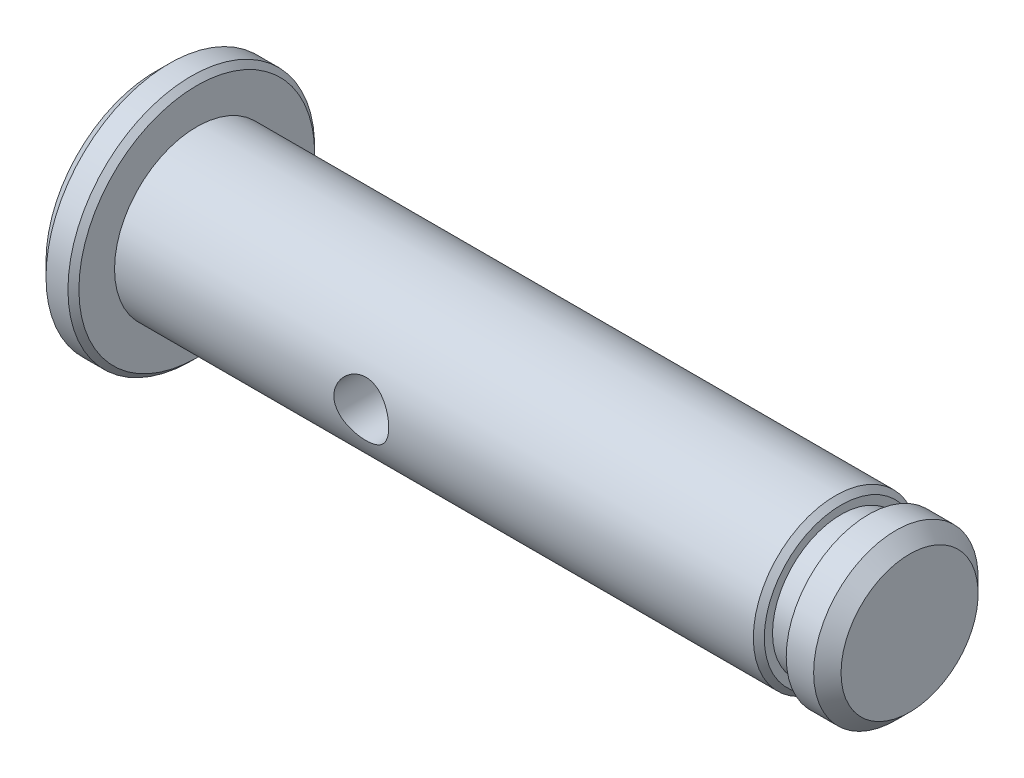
from build123d import *

# Parameters (mm, degrees)
CHAMFER_1_SIZE      = 0.5
SKETCH_2_R          = 1
CUT_EXTRUDE_1_DEPTH = 15
CHAMFER_2_SIZE      = 0.2


with BuildPart() as part:
    # Sketch 1 → Revolve 1 (revolve)
    with BuildSketch(Plane.XY, mode=Mode.PRIVATE) as revolve_1_sk:
        Polygon((0, 0), (0, 4.5), (1.5, 4.5), (1.5, 3), (25, 3), (25, 2.5), (26, 2.5), (26, 3), (27.5, 3), (27.5, 0), align=None)
    revolve(revolve_1_sk.sketch.rotate(Axis((0, 0, 0), (1, 0, 0)), 90), axis=Axis((0, 0, 0), (1, 0, 0)))

    # Chamfer 1
    chamfer_1_edges = [part.edges().sort_by_distance(p)[0] for p in [
        (0, 0, -4.5),
        (27.5, 0, -3),
    ]]
    chamfer(chamfer_1_edges, length=CHAMFER_1_SIZE)

    # Sketch 2 → Cut-Extrude 1 (cut, symmetric)
    with BuildSketch(Plane.XY):
        with Locations((10.5, 0)):
            Circle(SKETCH_2_R)
    extrude(amount=CUT_EXTRUDE_1_DEPTH, both=True, mode=Mode.SUBTRACT)

    # Chamfer 2
    chamfer_2_edges = [part.edges().sort_by_distance(p)[0] for p in [
        (1.5, 0, -4.5),
        (25, 0, -3),
    ]]
    chamfer(chamfer_2_edges, length=CHAMFER_2_SIZE)


solid = part.part
